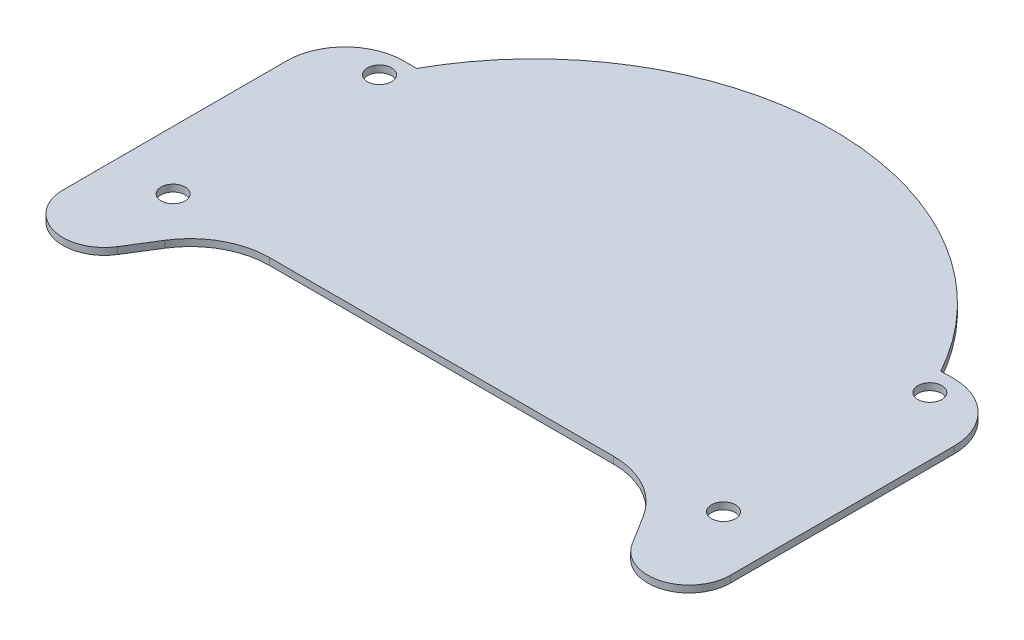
ISO-10303-21;
HEADER;
FILE_DESCRIPTION(('STEP AP214'),'2;1');
FILE_NAME('part.step','',(''),(''),'','','');
FILE_SCHEMA(('AUTOMOTIVE_DESIGN { 1 0 10303 214 1 1 1 1 }'));
ENDSEC;
DATA;
#1=APPLICATION_CONTEXT('core data for automotive mechanical design processes');
#2=APPLICATION_PROTOCOL_DEFINITION('international standard','automotive_design',2000,#1);
#3=PRODUCT_CONTEXT('',#1,'mechanical');
#4=PRODUCT('Part','Part','',(#3));
#5=PRODUCT_RELATED_PRODUCT_CATEGORY('part','',(#4));
#6=PRODUCT_DEFINITION_FORMATION('','',#4);
#7=PRODUCT_DEFINITION_CONTEXT('part definition',#1,'design');
#8=PRODUCT_DEFINITION('design','',#6,#7);
#9=PRODUCT_DEFINITION_SHAPE('','',#8);
#10=(LENGTH_UNIT() NAMED_UNIT(*) SI_UNIT(.MILLI.,.METRE.));
#11=(NAMED_UNIT(*) PLANE_ANGLE_UNIT() SI_UNIT($,.RADIAN.));
#12=(NAMED_UNIT(*) SI_UNIT($,.STERADIAN.) SOLID_ANGLE_UNIT());
#13=UNCERTAINTY_MEASURE_WITH_UNIT(LENGTH_MEASURE(1.E-05),#10,'distance_accuracy_value','');
#14=(GEOMETRIC_REPRESENTATION_CONTEXT(3) GLOBAL_UNCERTAINTY_ASSIGNED_CONTEXT((#13)) GLOBAL_UNIT_ASSIGNED_CONTEXT((#10,
#11,#12)) REPRESENTATION_CONTEXT('',''));
#15=CARTESIAN_POINT('',(0.,0.,0.));
#16=DIRECTION('',(0.,0.,1.));
#17=DIRECTION('',(1.,0.,0.));
#18=AXIS2_PLACEMENT_3D('',#15,#16,#17);
#19=CARTESIAN_POINT('',(80.,2.,-55.));
#20=DIRECTION('',(0.,1.,0.));
#21=DIRECTION('',(0.,0.,1.));
#22=AXIS2_PLACEMENT_3D('',#19,#20,#21);
#23=PLANE('',#22);
#24=CARTESIAN_POINT('',(80.,2.,-5.));
#25=DIRECTION('',(0.,1.,0.));
#26=DIRECTION('',(0.,0.,1.));
#27=AXIS2_PLACEMENT_3D('',#24,#25,#26);
#28=CIRCLE('',#27,3.50000000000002);
#29=CARTESIAN_POINT('',(80.,2.,-1.49999999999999));
#30=VERTEX_POINT('',#29);
#31=EDGE_CURVE('E370',#30,#30,#28,.T.);
#32=ORIENTED_EDGE('',*,*,#31,.F.);
#33=EDGE_LOOP('',(#32));
#34=FACE_BOUND('',#33,.T.);
#35=CARTESIAN_POINT('',(-80.,2.,-65.));
#36=DIRECTION('',(0.,1.,0.));
#37=DIRECTION('',(0.,0.,1.));
#38=AXIS2_PLACEMENT_3D('',#35,#36,#37);
#39=CIRCLE('',#38,3.5);
#40=CARTESIAN_POINT('',(-80.,2.,-61.5));
#41=VERTEX_POINT('',#40);
#42=EDGE_CURVE('E188',#41,#41,#39,.T.);
#43=ORIENTED_EDGE('',*,*,#42,.F.);
#44=EDGE_LOOP('',(#43));
#45=FACE_BOUND('',#44,.T.);
#46=CARTESIAN_POINT('',(80.,2.,-55.));
#47=DIRECTION('',(0.,1.,0.));
#48=DIRECTION('',(0.,0.,1.));
#49=AXIS2_PLACEMENT_3D('',#46,#47,#48);
#50=CIRCLE('',#49,17.);
#51=CARTESIAN_POINT('',(97.,2.,-55.));
#52=VERTEX_POINT('',#51);
#53=CARTESIAN_POINT('',(80.,2.,-72.));
#54=VERTEX_POINT('',#53);
#55=EDGE_CURVE('E224',#52,#54,#50,.T.);
#56=ORIENTED_EDGE('',*,*,#55,.T.);
#57=DIRECTION('',(-1.,0.,0.));
#58=VECTOR('',#57,1.);
#59=CARTESIAN_POINT('',(80.,2.,-72.));
#60=LINE('',#59,#58);
#61=CARTESIAN_POINT('',(76.1905505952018,2.,-72.));
#62=VERTEX_POINT('',#61);
#63=EDGE_CURVE('E124',#54,#62,#60,.T.);
#64=ORIENTED_EDGE('',*,*,#63,.T.);
#65=CARTESIAN_POINT('',(0.,2.,-30.));
#66=DIRECTION('',(0.,1.,0.));
#67=DIRECTION('',(0.,0.,1.));
#68=AXIS2_PLACEMENT_3D('',#65,#66,#67);
#69=CIRCLE('',#68,87.);
#70=CARTESIAN_POINT('',(-76.1905505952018,2.,-72.));
#71=VERTEX_POINT('',#70);
#72=EDGE_CURVE('E269',#62,#71,#69,.T.);
#73=ORIENTED_EDGE('',*,*,#72,.T.);
#74=DIRECTION('',(-1.,0.,0.));
#75=VECTOR('',#74,1.);
#76=CARTESIAN_POINT('',(-80.,2.,-72.));
#77=LINE('',#76,#75);
#78=CARTESIAN_POINT('',(-80.,2.,-72.));
#79=VERTEX_POINT('',#78);
#80=EDGE_CURVE('E289',#71,#79,#77,.T.);
#81=ORIENTED_EDGE('',*,*,#80,.T.);
#82=CARTESIAN_POINT('',(-80.,2.,-55.));
#83=DIRECTION('',(0.,1.,0.));
#84=DIRECTION('',(0.,0.,1.));
#85=AXIS2_PLACEMENT_3D('',#82,#83,#84);
#86=CIRCLE('',#85,17.);
#87=CARTESIAN_POINT('',(-97.,2.,-55.));
#88=VERTEX_POINT('',#87);
#89=EDGE_CURVE('E285',#79,#88,#86,.T.);
#90=ORIENTED_EDGE('',*,*,#89,.T.);
#91=DIRECTION('',(0.,0.,1.));
#92=VECTOR('',#91,1.);
#93=CARTESIAN_POINT('',(-97.,2.,10.));
#94=LINE('',#93,#92);
#95=CARTESIAN_POINT('',(-97.,2.,10.));
#96=VERTEX_POINT('',#95);
#97=EDGE_CURVE('E288',#88,#96,#94,.T.);
#98=ORIENTED_EDGE('',*,*,#97,.T.);
#99=CARTESIAN_POINT('',(-85.,2.,10.));
#100=DIRECTION('',(0.,1.,0.));
#101=DIRECTION('',(0.,0.,1.));
#102=AXIS2_PLACEMENT_3D('',#99,#100,#101);
#103=CIRCLE('',#102,12.);
#104=CARTESIAN_POINT('',(-74.811320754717,2.,16.3396226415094));
#105=VERTEX_POINT('',#104);
#106=EDGE_CURVE('E293',#96,#105,#103,.T.);
#107=ORIENTED_EDGE('',*,*,#106,.T.);
#108=DIRECTION('',(0.528301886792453,0.,-0.849056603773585));
#109=VECTOR('',#108,1.);
#110=CARTESIAN_POINT('',(-69.5283018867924,2.,7.8490566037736));
#111=LINE('',#110,#109);
#112=CARTESIAN_POINT('',(-69.5283018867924,2.,7.8490566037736));
#113=VERTEX_POINT('',#112);
#114=EDGE_CURVE('E300',#105,#113,#111,.T.);
#115=ORIENTED_EDGE('',*,*,#114,.T.);
#116=CARTESIAN_POINT('',(-50.,2.,20.));
#117=DIRECTION('',(0.,-1.,0.));
#118=DIRECTION('',(0.,0.,1.));
#119=AXIS2_PLACEMENT_3D('',#116,#117,#118);
#120=CIRCLE('',#119,23.);
#121=CARTESIAN_POINT('',(-50.,2.,-2.99999999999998));
#122=VERTEX_POINT('',#121);
#123=EDGE_CURVE('E303',#113,#122,#120,.T.);
#124=ORIENTED_EDGE('',*,*,#123,.T.);
#125=DIRECTION('',(1.,0.,0.));
#126=VECTOR('',#125,1.);
#127=CARTESIAN_POINT('',(50.,2.,-2.99999999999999));
#128=LINE('',#127,#126);
#129=CARTESIAN_POINT('',(50.,2.,-2.99999999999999));
#130=VERTEX_POINT('',#129);
#131=EDGE_CURVE('E306',#122,#130,#128,.T.);
#132=ORIENTED_EDGE('',*,*,#131,.T.);
#133=CARTESIAN_POINT('',(50.,2.,20.));
#134=DIRECTION('',(0.,-1.,0.));
#135=DIRECTION('',(0.,0.,1.));
#136=AXIS2_PLACEMENT_3D('',#133,#134,#135);
#137=CIRCLE('',#136,23.);
#138=CARTESIAN_POINT('',(69.5283018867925,2.,7.84905660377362));
#139=VERTEX_POINT('',#138);
#140=EDGE_CURVE('E161',#130,#139,#137,.T.);
#141=ORIENTED_EDGE('',*,*,#140,.T.);
#142=DIRECTION('',(0.528301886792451,0.,0.849056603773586));
#143=VECTOR('',#142,1.);
#144=CARTESIAN_POINT('',(69.5283018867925,2.,7.84905660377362));
#145=LINE('',#144,#143);
#146=CARTESIAN_POINT('',(74.811320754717,2.,16.3396226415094));
#147=VERTEX_POINT('',#146);
#148=EDGE_CURVE('E155',#139,#147,#145,.T.);
#149=ORIENTED_EDGE('',*,*,#148,.T.);
#150=CARTESIAN_POINT('',(85.,2.,10.));
#151=DIRECTION('',(0.,1.,0.));
#152=DIRECTION('',(0.,0.,1.));
#153=AXIS2_PLACEMENT_3D('',#150,#151,#152);
#154=CIRCLE('',#153,12.);
#155=CARTESIAN_POINT('',(97.,2.,10.));
#156=VERTEX_POINT('',#155);
#157=EDGE_CURVE('E159',#147,#156,#154,.T.);
#158=ORIENTED_EDGE('',*,*,#157,.T.);
#159=DIRECTION('',(0.,0.,-1.));
#160=VECTOR('',#159,1.);
#161=CARTESIAN_POINT('',(97.,2.,10.));
#162=LINE('',#161,#160);
#163=EDGE_CURVE('E63',#156,#52,#162,.T.);
#164=ORIENTED_EDGE('',*,*,#163,.T.);
#165=EDGE_LOOP('',(#56,#64,#73,#81,#90,#98,#107,#115,#124,#132,#141,#149,#158,#164));
#166=FACE_BOUND('',#165,.T.);
#167=CARTESIAN_POINT('',(80.,2.,-65.));
#168=DIRECTION('',(0.,1.,0.));
#169=DIRECTION('',(0.,0.,1.));
#170=AXIS2_PLACEMENT_3D('',#167,#168,#169);
#171=CIRCLE('',#170,3.49999999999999);
#172=CARTESIAN_POINT('',(80.,2.,-61.5));
#173=VERTEX_POINT('',#172);
#174=EDGE_CURVE('E378',#173,#173,#171,.T.);
#175=ORIENTED_EDGE('',*,*,#174,.F.);
#176=EDGE_LOOP('',(#175));
#177=FACE_BOUND('',#176,.T.);
#178=CARTESIAN_POINT('',(-80.,2.,-5.));
#179=DIRECTION('',(0.,1.,0.));
#180=DIRECTION('',(0.,0.,1.));
#181=AXIS2_PLACEMENT_3D('',#178,#179,#180);
#182=CIRCLE('',#181,3.50000000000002);
#183=CARTESIAN_POINT('',(-80.,2.,-1.49999999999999));
#184=VERTEX_POINT('',#183);
#185=EDGE_CURVE('E359',#184,#184,#182,.T.);
#186=ORIENTED_EDGE('',*,*,#185,.F.);
#187=EDGE_LOOP('',(#186));
#188=FACE_BOUND('',#187,.T.);
#189=ADVANCED_FACE('F45',(#34,#45,#166,#177,#188),#23,.T.);
#190=CARTESIAN_POINT('',(80.,0.,-55.));
#191=DIRECTION('',(0.,1.,0.));
#192=DIRECTION('',(0.,0.,1.));
#193=AXIS2_PLACEMENT_3D('',#190,#191,#192);
#194=PLANE('',#193);
#195=CARTESIAN_POINT('',(80.,0.,-55.));
#196=DIRECTION('',(0.,1.,0.));
#197=DIRECTION('',(0.,0.,1.));
#198=AXIS2_PLACEMENT_3D('',#195,#196,#197);
#199=CIRCLE('',#198,17.);
#200=CARTESIAN_POINT('',(97.,0.,-55.));
#201=VERTEX_POINT('',#200);
#202=CARTESIAN_POINT('',(80.,0.,-72.));
#203=VERTEX_POINT('',#202);
#204=EDGE_CURVE('E183',#201,#203,#199,.T.);
#205=ORIENTED_EDGE('',*,*,#204,.F.);
#206=DIRECTION('',(0.,0.,-1.));
#207=VECTOR('',#206,1.);
#208=CARTESIAN_POINT('',(97.,0.,10.));
#209=LINE('',#208,#207);
#210=CARTESIAN_POINT('',(97.,0.,10.));
#211=VERTEX_POINT('',#210);
#212=EDGE_CURVE('E116',#211,#201,#209,.T.);
#213=ORIENTED_EDGE('',*,*,#212,.F.);
#214=CARTESIAN_POINT('',(85.,0.,10.));
#215=DIRECTION('',(0.,1.,0.));
#216=DIRECTION('',(0.,0.,1.));
#217=AXIS2_PLACEMENT_3D('',#214,#215,#216);
#218=CIRCLE('',#217,12.);
#219=CARTESIAN_POINT('',(74.811320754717,0.,16.3396226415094));
#220=VERTEX_POINT('',#219);
#221=EDGE_CURVE('E110',#220,#211,#218,.T.);
#222=ORIENTED_EDGE('',*,*,#221,.F.);
#223=DIRECTION('',(0.528301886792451,0.,0.849056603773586));
#224=VECTOR('',#223,1.);
#225=CARTESIAN_POINT('',(69.5283018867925,0.,7.84905660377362));
#226=LINE('',#225,#224);
#227=CARTESIAN_POINT('',(69.5283018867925,0.,7.84905660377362));
#228=VERTEX_POINT('',#227);
#229=EDGE_CURVE('E170',#228,#220,#226,.T.);
#230=ORIENTED_EDGE('',*,*,#229,.F.);
#231=CARTESIAN_POINT('',(50.,0.,20.));
#232=DIRECTION('',(0.,-1.,0.));
#233=DIRECTION('',(0.,0.,1.));
#234=AXIS2_PLACEMENT_3D('',#231,#232,#233);
#235=CIRCLE('',#234,23.);
#236=CARTESIAN_POINT('',(50.,0.,-2.99999999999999));
#237=VERTEX_POINT('',#236);
#238=EDGE_CURVE('E215',#237,#228,#235,.T.);
#239=ORIENTED_EDGE('',*,*,#238,.F.);
#240=DIRECTION('',(1.,0.,0.));
#241=VECTOR('',#240,1.);
#242=CARTESIAN_POINT('',(50.,0.,-2.99999999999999));
#243=LINE('',#242,#241);
#244=CARTESIAN_POINT('',(-50.,0.,-2.99999999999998));
#245=VERTEX_POINT('',#244);
#246=EDGE_CURVE('E212',#245,#237,#243,.T.);
#247=ORIENTED_EDGE('',*,*,#246,.F.);
#248=CARTESIAN_POINT('',(-50.,0.,20.));
#249=DIRECTION('',(0.,-1.,0.));
#250=DIRECTION('',(0.,0.,1.));
#251=AXIS2_PLACEMENT_3D('',#248,#249,#250);
#252=CIRCLE('',#251,23.);
#253=CARTESIAN_POINT('',(-69.5283018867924,0.,7.8490566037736));
#254=VERTEX_POINT('',#253);
#255=EDGE_CURVE('E209',#254,#245,#252,.T.);
#256=ORIENTED_EDGE('',*,*,#255,.F.);
#257=DIRECTION('',(0.528301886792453,0.,-0.849056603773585));
#258=VECTOR('',#257,1.);
#259=CARTESIAN_POINT('',(-69.5283018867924,0.,7.8490566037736));
#260=LINE('',#259,#258);
#261=CARTESIAN_POINT('',(-74.811320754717,0.,16.3396226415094));
#262=VERTEX_POINT('',#261);
#263=EDGE_CURVE('E206',#262,#254,#260,.T.);
#264=ORIENTED_EDGE('',*,*,#263,.F.);
#265=CARTESIAN_POINT('',(-85.,0.,10.));
#266=DIRECTION('',(0.,1.,0.));
#267=DIRECTION('',(0.,0.,1.));
#268=AXIS2_PLACEMENT_3D('',#265,#266,#267);
#269=CIRCLE('',#268,12.);
#270=CARTESIAN_POINT('',(-97.,0.,10.));
#271=VERTEX_POINT('',#270);
#272=EDGE_CURVE('E203',#271,#262,#269,.T.);
#273=ORIENTED_EDGE('',*,*,#272,.F.);
#274=DIRECTION('',(0.,0.,1.));
#275=VECTOR('',#274,1.);
#276=CARTESIAN_POINT('',(-97.,0.,10.));
#277=LINE('',#276,#275);
#278=CARTESIAN_POINT('',(-97.,0.,-55.));
#279=VERTEX_POINT('',#278);
#280=EDGE_CURVE('E200',#279,#271,#277,.T.);
#281=ORIENTED_EDGE('',*,*,#280,.F.);
#282=CARTESIAN_POINT('',(-80.,0.,-55.));
#283=DIRECTION('',(0.,1.,0.));
#284=DIRECTION('',(0.,0.,1.));
#285=AXIS2_PLACEMENT_3D('',#282,#283,#284);
#286=CIRCLE('',#285,17.);
#287=CARTESIAN_POINT('',(-80.,0.,-72.));
#288=VERTEX_POINT('',#287);
#289=EDGE_CURVE('E197',#288,#279,#286,.T.);
#290=ORIENTED_EDGE('',*,*,#289,.F.);
#291=DIRECTION('',(-1.,0.,0.));
#292=VECTOR('',#291,1.);
#293=CARTESIAN_POINT('',(-80.,0.,-72.));
#294=LINE('',#293,#292);
#295=CARTESIAN_POINT('',(-76.1905505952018,0.,-72.));
#296=VERTEX_POINT('',#295);
#297=EDGE_CURVE('E194',#296,#288,#294,.T.);
#298=ORIENTED_EDGE('',*,*,#297,.F.);
#299=CARTESIAN_POINT('',(0.,0.,-30.));
#300=DIRECTION('',(0.,1.,0.));
#301=DIRECTION('',(0.,0.,1.));
#302=AXIS2_PLACEMENT_3D('',#299,#300,#301);
#303=CIRCLE('',#302,87.);
#304=CARTESIAN_POINT('',(76.1905505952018,0.,-72.));
#305=VERTEX_POINT('',#304);
#306=EDGE_CURVE('E191',#305,#296,#303,.T.);
#307=ORIENTED_EDGE('',*,*,#306,.F.);
#308=DIRECTION('',(-1.,0.,0.));
#309=VECTOR('',#308,1.);
#310=CARTESIAN_POINT('',(80.,0.,-72.));
#311=LINE('',#310,#309);
#312=EDGE_CURVE('E187',#203,#305,#311,.T.);
#313=ORIENTED_EDGE('',*,*,#312,.F.);
#314=EDGE_LOOP('',(#205,#213,#222,#230,#239,#247,#256,#264,#273,#281,#290,#298,#307,#313));
#315=FACE_BOUND('',#314,.T.);
#316=CARTESIAN_POINT('',(-80.,0.,-65.));
#317=DIRECTION('',(0.,1.,0.));
#318=DIRECTION('',(0.,0.,1.));
#319=AXIS2_PLACEMENT_3D('',#316,#317,#318);
#320=CIRCLE('',#319,3.5);
#321=CARTESIAN_POINT('',(-80.,0.,-61.5));
#322=VERTEX_POINT('',#321);
#323=EDGE_CURVE('E382',#322,#322,#320,.T.);
#324=ORIENTED_EDGE('',*,*,#323,.T.);
#325=EDGE_LOOP('',(#324));
#326=FACE_BOUND('',#325,.T.);
#327=CARTESIAN_POINT('',(80.,0.,-65.));
#328=DIRECTION('',(0.,1.,0.));
#329=DIRECTION('',(0.,0.,1.));
#330=AXIS2_PLACEMENT_3D('',#327,#328,#329);
#331=CIRCLE('',#330,3.49999999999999);
#332=CARTESIAN_POINT('',(80.,0.,-61.5));
#333=VERTEX_POINT('',#332);
#334=EDGE_CURVE('E374',#333,#333,#331,.T.);
#335=ORIENTED_EDGE('',*,*,#334,.T.);
#336=EDGE_LOOP('',(#335));
#337=FACE_BOUND('',#336,.T.);
#338=CARTESIAN_POINT('',(80.,0.,-5.));
#339=DIRECTION('',(0.,1.,0.));
#340=DIRECTION('',(0.,0.,1.));
#341=AXIS2_PLACEMENT_3D('',#338,#339,#340);
#342=CIRCLE('',#341,3.50000000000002);
#343=CARTESIAN_POINT('',(80.,0.,-1.49999999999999));
#344=VERTEX_POINT('',#343);
#345=EDGE_CURVE('E367',#344,#344,#342,.T.);
#346=ORIENTED_EDGE('',*,*,#345,.T.);
#347=EDGE_LOOP('',(#346));
#348=FACE_BOUND('',#347,.T.);
#349=CARTESIAN_POINT('',(-80.,0.,-5.));
#350=DIRECTION('',(0.,1.,0.));
#351=DIRECTION('',(0.,0.,1.));
#352=AXIS2_PLACEMENT_3D('',#349,#350,#351);
#353=CIRCLE('',#352,3.50000000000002);
#354=CARTESIAN_POINT('',(-80.,0.,-1.49999999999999));
#355=VERTEX_POINT('',#354);
#356=EDGE_CURVE('E362',#355,#355,#353,.T.);
#357=ORIENTED_EDGE('',*,*,#356,.T.);
#358=EDGE_LOOP('',(#357));
#359=FACE_BOUND('',#358,.T.);
#360=ADVANCED_FACE('F273',(#315,#326,#337,#348,#359),#194,.F.);
#361=CARTESIAN_POINT('',(80.,2.,-55.));
#362=DIRECTION('',(0.,-1.,0.));
#363=DIRECTION('',(0.,0.,-1.));
#364=AXIS2_PLACEMENT_3D('',#361,#362,#363);
#365=CYLINDRICAL_SURFACE('',#364,17.);
#366=ORIENTED_EDGE('',*,*,#204,.T.);
#367=DIRECTION('',(0.,-1.,0.));
#368=VECTOR('',#367,1.);
#369=CARTESIAN_POINT('',(80.,2.,-72.));
#370=LINE('',#369,#368);
#371=EDGE_CURVE('E11',#54,#203,#370,.T.);
#372=ORIENTED_EDGE('',*,*,#371,.F.);
#373=ORIENTED_EDGE('',*,*,#55,.F.);
#374=DIRECTION('',(0.,-1.,0.));
#375=VECTOR('',#374,1.);
#376=CARTESIAN_POINT('',(97.,2.,-55.));
#377=LINE('',#376,#375);
#378=EDGE_CURVE('E179',#52,#201,#377,.T.);
#379=ORIENTED_EDGE('',*,*,#378,.T.);
#380=EDGE_LOOP('',(#366,#372,#373,#379));
#381=FACE_BOUND('',#380,.T.);
#382=ADVANCED_FACE('F47',(#381),#365,.T.);
#383=CARTESIAN_POINT('',(80.,2.,-72.));
#384=DIRECTION('',(0.,0.,1.));
#385=DIRECTION('',(1.,0.,0.));
#386=AXIS2_PLACEMENT_3D('',#383,#384,#385);
#387=PLANE('',#386);
#388=ORIENTED_EDGE('',*,*,#312,.T.);
#389=DIRECTION('',(0.,-1.,0.));
#390=VECTOR('',#389,1.);
#391=CARTESIAN_POINT('',(76.1905505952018,2.,-72.));
#392=LINE('',#391,#390);
#393=EDGE_CURVE('E55',#62,#305,#392,.T.);
#394=ORIENTED_EDGE('',*,*,#393,.F.);
#395=ORIENTED_EDGE('',*,*,#63,.F.);
#396=ORIENTED_EDGE('',*,*,#371,.T.);
#397=EDGE_LOOP('',(#388,#394,#395,#396));
#398=FACE_BOUND('',#397,.T.);
#399=ADVANCED_FACE('F522',(#398),#387,.F.);
#400=CARTESIAN_POINT('',(0.,2.,-30.));
#401=DIRECTION('',(0.,-1.,0.));
#402=DIRECTION('',(0.,0.,-1.));
#403=AXIS2_PLACEMENT_3D('',#400,#401,#402);
#404=CYLINDRICAL_SURFACE('',#403,87.);
#405=ORIENTED_EDGE('',*,*,#306,.T.);
#406=DIRECTION('',(0.,-1.,0.));
#407=VECTOR('',#406,1.);
#408=CARTESIAN_POINT('',(-76.1905505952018,2.,-72.));
#409=LINE('',#408,#407);
#410=EDGE_CURVE('E259',#71,#296,#409,.T.);
#411=ORIENTED_EDGE('',*,*,#410,.F.);
#412=ORIENTED_EDGE('',*,*,#72,.F.);
#413=ORIENTED_EDGE('',*,*,#393,.T.);
#414=EDGE_LOOP('',(#405,#411,#412,#413));
#415=FACE_BOUND('',#414,.T.);
#416=ADVANCED_FACE('F267',(#415),#404,.T.);
#417=CARTESIAN_POINT('',(-80.,2.,-72.));
#418=DIRECTION('',(0.,0.,1.));
#419=DIRECTION('',(1.,0.,0.));
#420=AXIS2_PLACEMENT_3D('',#417,#418,#419);
#421=PLANE('',#420);
#422=ORIENTED_EDGE('',*,*,#297,.T.);
#423=DIRECTION('',(0.,-1.,0.));
#424=VECTOR('',#423,1.);
#425=CARTESIAN_POINT('',(-80.,2.,-72.));
#426=LINE('',#425,#424);
#427=EDGE_CURVE('E255',#79,#288,#426,.T.);
#428=ORIENTED_EDGE('',*,*,#427,.F.);
#429=ORIENTED_EDGE('',*,*,#80,.F.);
#430=ORIENTED_EDGE('',*,*,#410,.T.);
#431=EDGE_LOOP('',(#422,#428,#429,#430));
#432=FACE_BOUND('',#431,.T.);
#433=ADVANCED_FACE('F279',(#432),#421,.F.);
#434=CARTESIAN_POINT('',(-80.,2.,-55.));
#435=DIRECTION('',(0.,-1.,0.));
#436=DIRECTION('',(0.,0.,-1.));
#437=AXIS2_PLACEMENT_3D('',#434,#435,#436);
#438=CYLINDRICAL_SURFACE('',#437,17.);
#439=ORIENTED_EDGE('',*,*,#289,.T.);
#440=DIRECTION('',(0.,-1.,0.));
#441=VECTOR('',#440,1.);
#442=CARTESIAN_POINT('',(-97.,2.,-55.));
#443=LINE('',#442,#441);
#444=EDGE_CURVE('E251',#88,#279,#443,.T.);
#445=ORIENTED_EDGE('',*,*,#444,.F.);
#446=ORIENTED_EDGE('',*,*,#89,.F.);
#447=ORIENTED_EDGE('',*,*,#427,.T.);
#448=EDGE_LOOP('',(#439,#445,#446,#447));
#449=FACE_BOUND('',#448,.T.);
#450=ADVANCED_FACE('F283',(#449),#438,.T.);
#451=CARTESIAN_POINT('',(-97.,2.,10.));
#452=DIRECTION('',(1.,0.,0.));
#453=DIRECTION('',(0.,0.,-1.));
#454=AXIS2_PLACEMENT_3D('',#451,#452,#453);
#455=PLANE('',#454);
#456=ORIENTED_EDGE('',*,*,#280,.T.);
#457=DIRECTION('',(0.,-1.,0.));
#458=VECTOR('',#457,1.);
#459=CARTESIAN_POINT('',(-97.,2.,10.));
#460=LINE('',#459,#458);
#461=EDGE_CURVE('E247',#96,#271,#460,.T.);
#462=ORIENTED_EDGE('',*,*,#461,.F.);
#463=ORIENTED_EDGE('',*,*,#97,.F.);
#464=ORIENTED_EDGE('',*,*,#444,.T.);
#465=EDGE_LOOP('',(#456,#462,#463,#464));
#466=FACE_BOUND('',#465,.T.);
#467=ADVANCED_FACE('F487',(#466),#455,.F.);
#468=CARTESIAN_POINT('',(-85.,2.,10.));
#469=DIRECTION('',(0.,-1.,0.));
#470=DIRECTION('',(0.,0.,-1.));
#471=AXIS2_PLACEMENT_3D('',#468,#469,#470);
#472=CYLINDRICAL_SURFACE('',#471,12.);
#473=ORIENTED_EDGE('',*,*,#272,.T.);
#474=DIRECTION('',(0.,-1.,0.));
#475=VECTOR('',#474,1.);
#476=CARTESIAN_POINT('',(-74.811320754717,2.,16.3396226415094));
#477=LINE('',#476,#475);
#478=EDGE_CURVE('E243',#105,#262,#477,.T.);
#479=ORIENTED_EDGE('',*,*,#478,.F.);
#480=ORIENTED_EDGE('',*,*,#106,.F.);
#481=ORIENTED_EDGE('',*,*,#461,.T.);
#482=EDGE_LOOP('',(#473,#479,#480,#481));
#483=FACE_BOUND('',#482,.T.);
#484=ADVANCED_FACE('F477',(#483),#472,.T.);
#485=CARTESIAN_POINT('',(-69.5283018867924,2.,7.8490566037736));
#486=DIRECTION('',(-0.849056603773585,0.,-0.528301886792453));
#487=DIRECTION('',(-0.528301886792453,0.,0.849056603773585));
#488=AXIS2_PLACEMENT_3D('',#485,#486,#487);
#489=PLANE('',#488);
#490=ORIENTED_EDGE('',*,*,#263,.T.);
#491=DIRECTION('',(0.,-1.,0.));
#492=VECTOR('',#491,1.);
#493=CARTESIAN_POINT('',(-69.5283018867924,2.,7.8490566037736));
#494=LINE('',#493,#492);
#495=EDGE_CURVE('E239',#113,#254,#494,.T.);
#496=ORIENTED_EDGE('',*,*,#495,.F.);
#497=ORIENTED_EDGE('',*,*,#114,.F.);
#498=ORIENTED_EDGE('',*,*,#478,.T.);
#499=EDGE_LOOP('',(#490,#496,#497,#498));
#500=FACE_BOUND('',#499,.T.);
#501=ADVANCED_FACE('F467',(#500),#489,.F.);
#502=CARTESIAN_POINT('',(-50.,2.,20.));
#503=DIRECTION('',(0.,-1.,0.));
#504=DIRECTION('',(0.,0.,-1.));
#505=AXIS2_PLACEMENT_3D('',#502,#503,#504);
#506=CYLINDRICAL_SURFACE('',#505,23.);
#507=ORIENTED_EDGE('',*,*,#255,.T.);
#508=DIRECTION('',(0.,-1.,0.));
#509=VECTOR('',#508,1.);
#510=CARTESIAN_POINT('',(-50.,2.,-2.99999999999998));
#511=LINE('',#510,#509);
#512=EDGE_CURVE('E235',#122,#245,#511,.T.);
#513=ORIENTED_EDGE('',*,*,#512,.F.);
#514=ORIENTED_EDGE('',*,*,#123,.F.);
#515=ORIENTED_EDGE('',*,*,#495,.T.);
#516=EDGE_LOOP('',(#507,#513,#514,#515));
#517=FACE_BOUND('',#516,.T.);
#518=ADVANCED_FACE('F458',(#517),#506,.F.);
#519=CARTESIAN_POINT('',(50.,2.,-2.99999999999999));
#520=DIRECTION('',(0.,0.,-1.));
#521=DIRECTION('',(-1.,0.,0.));
#522=AXIS2_PLACEMENT_3D('',#519,#520,#521);
#523=PLANE('',#522);
#524=ORIENTED_EDGE('',*,*,#246,.T.);
#525=DIRECTION('',(0.,-1.,0.));
#526=VECTOR('',#525,1.);
#527=CARTESIAN_POINT('',(50.,2.,-2.99999999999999));
#528=LINE('',#527,#526);
#529=EDGE_CURVE('E231',#130,#237,#528,.T.);
#530=ORIENTED_EDGE('',*,*,#529,.F.);
#531=ORIENTED_EDGE('',*,*,#131,.F.);
#532=ORIENTED_EDGE('',*,*,#512,.T.);
#533=EDGE_LOOP('',(#524,#530,#531,#532));
#534=FACE_BOUND('',#533,.T.);
#535=ADVANCED_FACE('F314',(#534),#523,.F.);
#536=CARTESIAN_POINT('',(50.,2.,20.));
#537=DIRECTION('',(0.,-1.,0.));
#538=DIRECTION('',(0.,0.,-1.));
#539=AXIS2_PLACEMENT_3D('',#536,#537,#538);
#540=CYLINDRICAL_SURFACE('',#539,23.);
#541=ORIENTED_EDGE('',*,*,#238,.T.);
#542=DIRECTION('',(0.,-1.,0.));
#543=VECTOR('',#542,1.);
#544=CARTESIAN_POINT('',(69.5283018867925,2.,7.84905660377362));
#545=LINE('',#544,#543);
#546=EDGE_CURVE('E172',#139,#228,#545,.T.);
#547=ORIENTED_EDGE('',*,*,#546,.F.);
#548=ORIENTED_EDGE('',*,*,#140,.F.);
#549=ORIENTED_EDGE('',*,*,#529,.T.);
#550=EDGE_LOOP('',(#541,#547,#548,#549));
#551=FACE_BOUND('',#550,.T.);
#552=ADVANCED_FACE('F318',(#551),#540,.F.);
#553=CARTESIAN_POINT('',(69.5283018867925,2.,7.84905660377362));
#554=DIRECTION('',(0.849056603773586,0.,-0.528301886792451));
#555=DIRECTION('',(-0.528301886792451,0.,-0.849056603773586));
#556=AXIS2_PLACEMENT_3D('',#553,#554,#555);
#557=PLANE('',#556);
#558=ORIENTED_EDGE('',*,*,#229,.T.);
#559=DIRECTION('',(0.,-1.,0.));
#560=VECTOR('',#559,1.);
#561=CARTESIAN_POINT('',(74.811320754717,2.,16.3396226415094));
#562=LINE('',#561,#560);
#563=EDGE_CURVE('E167',#147,#220,#562,.T.);
#564=ORIENTED_EDGE('',*,*,#563,.F.);
#565=ORIENTED_EDGE('',*,*,#148,.F.);
#566=ORIENTED_EDGE('',*,*,#546,.T.);
#567=EDGE_LOOP('',(#558,#564,#565,#566));
#568=FACE_BOUND('',#567,.T.);
#569=ADVANCED_FACE('F168',(#568),#557,.F.);
#570=CARTESIAN_POINT('',(85.,2.,10.));
#571=DIRECTION('',(0.,-1.,0.));
#572=DIRECTION('',(0.,0.,-1.));
#573=AXIS2_PLACEMENT_3D('',#570,#571,#572);
#574=CYLINDRICAL_SURFACE('',#573,12.);
#575=ORIENTED_EDGE('',*,*,#221,.T.);
#576=DIRECTION('',(0.,-1.,0.));
#577=VECTOR('',#576,1.);
#578=CARTESIAN_POINT('',(97.,2.,10.));
#579=LINE('',#578,#577);
#580=EDGE_CURVE('E173',#156,#211,#579,.T.);
#581=ORIENTED_EDGE('',*,*,#580,.F.);
#582=ORIENTED_EDGE('',*,*,#157,.F.);
#583=ORIENTED_EDGE('',*,*,#563,.T.);
#584=EDGE_LOOP('',(#575,#581,#582,#583));
#585=FACE_BOUND('',#584,.T.);
#586=ADVANCED_FACE('F175',(#585),#574,.T.);
#587=CARTESIAN_POINT('',(97.,2.,10.));
#588=DIRECTION('',(-1.,0.,0.));
#589=DIRECTION('',(0.,0.,1.));
#590=AXIS2_PLACEMENT_3D('',#587,#588,#589);
#591=PLANE('',#590);
#592=ORIENTED_EDGE('',*,*,#212,.T.);
#593=ORIENTED_EDGE('',*,*,#378,.F.);
#594=ORIENTED_EDGE('',*,*,#163,.F.);
#595=ORIENTED_EDGE('',*,*,#580,.T.);
#596=EDGE_LOOP('',(#592,#593,#594,#595));
#597=FACE_BOUND('',#596,.T.);
#598=ADVANCED_FACE('F322',(#597),#591,.F.);
#599=CARTESIAN_POINT('',(-80.,2.,-65.));
#600=DIRECTION('',(0.,-1.,0.));
#601=DIRECTION('',(0.,0.,-1.));
#602=AXIS2_PLACEMENT_3D('',#599,#600,#601);
#603=CYLINDRICAL_SURFACE('',#602,3.5);
#604=ORIENTED_EDGE('',*,*,#42,.T.);
#605=EDGE_LOOP('',(#604));
#606=FACE_BOUND('',#605,.T.);
#607=ORIENTED_EDGE('',*,*,#323,.F.);
#608=EDGE_LOOP('',(#607));
#609=FACE_BOUND('',#608,.T.);
#610=ADVANCED_FACE('F324',(#606,#609),#603,.F.);
#611=CARTESIAN_POINT('',(80.,2.,-65.));
#612=DIRECTION('',(0.,-1.,0.));
#613=DIRECTION('',(0.,0.,-1.));
#614=AXIS2_PLACEMENT_3D('',#611,#612,#613);
#615=CYLINDRICAL_SURFACE('',#614,3.49999999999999);
#616=ORIENTED_EDGE('',*,*,#174,.T.);
#617=EDGE_LOOP('',(#616));
#618=FACE_BOUND('',#617,.T.);
#619=ORIENTED_EDGE('',*,*,#334,.F.);
#620=EDGE_LOOP('',(#619));
#621=FACE_BOUND('',#620,.T.);
#622=ADVANCED_FACE('F330',(#618,#621),#615,.F.);
#623=CARTESIAN_POINT('',(80.,2.,-5.));
#624=DIRECTION('',(0.,-1.,0.));
#625=DIRECTION('',(0.,0.,-1.));
#626=AXIS2_PLACEMENT_3D('',#623,#624,#625);
#627=CYLINDRICAL_SURFACE('',#626,3.50000000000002);
#628=ORIENTED_EDGE('',*,*,#31,.T.);
#629=EDGE_LOOP('',(#628));
#630=FACE_BOUND('',#629,.T.);
#631=ORIENTED_EDGE('',*,*,#345,.F.);
#632=EDGE_LOOP('',(#631));
#633=FACE_BOUND('',#632,.T.);
#634=ADVANCED_FACE('F346',(#630,#633),#627,.F.);
#635=CARTESIAN_POINT('',(-80.,2.,-5.));
#636=DIRECTION('',(0.,-1.,0.));
#637=DIRECTION('',(0.,0.,-1.));
#638=AXIS2_PLACEMENT_3D('',#635,#636,#637);
#639=CYLINDRICAL_SURFACE('',#638,3.50000000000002);
#640=ORIENTED_EDGE('',*,*,#185,.T.);
#641=EDGE_LOOP('',(#640));
#642=FACE_BOUND('',#641,.T.);
#643=ORIENTED_EDGE('',*,*,#356,.F.);
#644=EDGE_LOOP('',(#643));
#645=FACE_BOUND('',#644,.T.);
#646=ADVANCED_FACE('F350',(#642,#645),#639,.F.);
#647=CLOSED_SHELL('',(#189,#360,#382,#399,#416,#433,#450,#467,#484,#501,#518,#535,#552,#569,
#586,#598,#610,#622,#634,#646));
#648=MANIFOLD_SOLID_BREP('B2',#647);
#649=ADVANCED_BREP_SHAPE_REPRESENTATION('',(#18,#648),#14);
#650=SHAPE_DEFINITION_REPRESENTATION(#9,#649);
ENDSEC;
END-ISO-10303-21;
